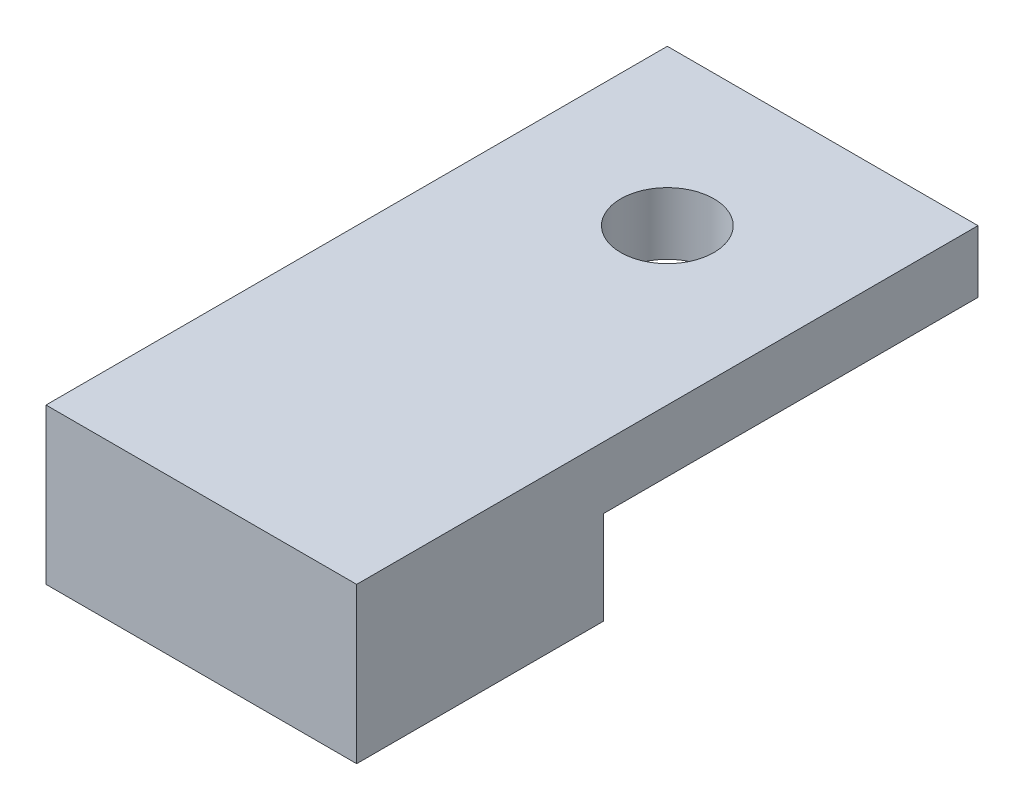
ISO-10303-21;
HEADER;
FILE_DESCRIPTION(('STEP AP214'),'2;1');
FILE_NAME('part.step','',(''),(''),'','','');
FILE_SCHEMA(('AUTOMOTIVE_DESIGN { 1 0 10303 214 1 1 1 1 }'));
ENDSEC;
DATA;
#1=APPLICATION_CONTEXT('core data for automotive mechanical design processes');
#2=APPLICATION_PROTOCOL_DEFINITION('international standard','automotive_design',2000,#1);
#3=PRODUCT_CONTEXT('',#1,'mechanical');
#4=PRODUCT('Part','Part','',(#3));
#5=PRODUCT_RELATED_PRODUCT_CATEGORY('part','',(#4));
#6=PRODUCT_DEFINITION_FORMATION('','',#4);
#7=PRODUCT_DEFINITION_CONTEXT('part definition',#1,'design');
#8=PRODUCT_DEFINITION('design','',#6,#7);
#9=PRODUCT_DEFINITION_SHAPE('','',#8);
#10=(LENGTH_UNIT() NAMED_UNIT(*) SI_UNIT(.MILLI.,.METRE.));
#11=(NAMED_UNIT(*) PLANE_ANGLE_UNIT() SI_UNIT($,.RADIAN.));
#12=(NAMED_UNIT(*) SI_UNIT($,.STERADIAN.) SOLID_ANGLE_UNIT());
#13=UNCERTAINTY_MEASURE_WITH_UNIT(LENGTH_MEASURE(1.E-05),#10,'distance_accuracy_value','');
#14=(GEOMETRIC_REPRESENTATION_CONTEXT(3) GLOBAL_UNCERTAINTY_ASSIGNED_CONTEXT((#13)) GLOBAL_UNIT_ASSIGNED_CONTEXT((#10,
#11,#12)) REPRESENTATION_CONTEXT('',''));
#15=CARTESIAN_POINT('',(0.,0.,0.));
#16=DIRECTION('',(0.,0.,1.));
#17=DIRECTION('',(1.,0.,0.));
#18=AXIS2_PLACEMENT_3D('',#15,#16,#17);
#19=CARTESIAN_POINT('',(10.,0.,-7.95));
#20=DIRECTION('',(0.,1.,0.));
#21=DIRECTION('',(0.,0.,1.));
#22=AXIS2_PLACEMENT_3D('',#19,#20,#21);
#23=PLANE('',#22);
#24=DIRECTION('',(0.,0.,-1.));
#25=VECTOR('',#24,1.);
#26=CARTESIAN_POINT('',(0.,0.,-7.95));
#27=LINE('',#26,#25);
#28=CARTESIAN_POINT('',(0.,0.,0.));
#29=VERTEX_POINT('',#28);
#30=CARTESIAN_POINT('',(0.,0.,-7.95));
#31=VERTEX_POINT('',#30);
#32=EDGE_CURVE('E117',#29,#31,#27,.T.);
#33=ORIENTED_EDGE('',*,*,#32,.T.);
#34=DIRECTION('',(-1.,0.,0.));
#35=VECTOR('',#34,1.);
#36=CARTESIAN_POINT('',(10.,0.,-7.95));
#37=LINE('',#36,#35);
#38=CARTESIAN_POINT('',(10.,0.,-7.95));
#39=VERTEX_POINT('',#38);
#40=EDGE_CURVE('E11',#39,#31,#37,.T.);
#41=ORIENTED_EDGE('',*,*,#40,.F.);
#42=DIRECTION('',(0.,0.,-1.));
#43=VECTOR('',#42,1.);
#44=CARTESIAN_POINT('',(10.,0.,-7.95));
#45=LINE('',#44,#43);
#46=CARTESIAN_POINT('',(10.,0.,0.));
#47=VERTEX_POINT('',#46);
#48=EDGE_CURVE('E128',#47,#39,#45,.T.);
#49=ORIENTED_EDGE('',*,*,#48,.F.);
#50=DIRECTION('',(-1.,0.,0.));
#51=VECTOR('',#50,1.);
#52=CARTESIAN_POINT('',(10.,0.,0.));
#53=LINE('',#52,#51);
#54=EDGE_CURVE('E113',#47,#29,#53,.T.);
#55=ORIENTED_EDGE('',*,*,#54,.T.);
#56=EDGE_LOOP('',(#33,#41,#49,#55));
#57=FACE_BOUND('',#56,.T.);
#58=ADVANCED_FACE('F33',(#57),#23,.F.);
#59=CARTESIAN_POINT('',(10.,3.,-7.95));
#60=DIRECTION('',(0.,0.,1.));
#61=DIRECTION('',(1.,0.,0.));
#62=AXIS2_PLACEMENT_3D('',#59,#60,#61);
#63=PLANE('',#62);
#64=DIRECTION('',(0.,1.,0.));
#65=VECTOR('',#64,1.);
#66=CARTESIAN_POINT('',(0.,3.,-7.95));
#67=LINE('',#66,#65);
#68=CARTESIAN_POINT('',(0.,3.,-7.95));
#69=VERTEX_POINT('',#68);
#70=EDGE_CURVE('E120',#31,#69,#67,.T.);
#71=ORIENTED_EDGE('',*,*,#70,.T.);
#72=DIRECTION('',(-1.,0.,0.));
#73=VECTOR('',#72,1.);
#74=CARTESIAN_POINT('',(10.,3.,-7.95));
#75=LINE('',#74,#73);
#76=CARTESIAN_POINT('',(10.,3.,-7.95));
#77=VERTEX_POINT('',#76);
#78=EDGE_CURVE('E41',#77,#69,#75,.T.);
#79=ORIENTED_EDGE('',*,*,#78,.F.);
#80=DIRECTION('',(0.,1.,0.));
#81=VECTOR('',#80,1.);
#82=CARTESIAN_POINT('',(10.,3.,-7.95));
#83=LINE('',#82,#81);
#84=EDGE_CURVE('E86',#39,#77,#83,.T.);
#85=ORIENTED_EDGE('',*,*,#84,.F.);
#86=ORIENTED_EDGE('',*,*,#40,.T.);
#87=EDGE_LOOP('',(#71,#79,#85,#86));
#88=FACE_BOUND('',#87,.T.);
#89=ADVANCED_FACE('F153',(#88),#63,.F.);
#90=CARTESIAN_POINT('',(10.,3.,-20.));
#91=DIRECTION('',(0.,1.,0.));
#92=DIRECTION('',(0.,0.,1.));
#93=AXIS2_PLACEMENT_3D('',#90,#91,#92);
#94=PLANE('',#93);
#95=CARTESIAN_POINT('',(5.,3.,-15.));
#96=DIRECTION('',(0.,1.,0.));
#97=DIRECTION('',(0.,0.,1.));
#98=AXIS2_PLACEMENT_3D('',#95,#96,#97);
#99=CIRCLE('',#98,1.5);
#100=CARTESIAN_POINT('',(5.,3.,-13.5));
#101=VERTEX_POINT('',#100);
#102=EDGE_CURVE('E121',#101,#101,#99,.T.);
#103=ORIENTED_EDGE('',*,*,#102,.T.);
#104=EDGE_LOOP('',(#103));
#105=FACE_BOUND('',#104,.T.);
#106=DIRECTION('',(0.,0.,-1.));
#107=VECTOR('',#106,1.);
#108=CARTESIAN_POINT('',(0.,3.,-20.));
#109=LINE('',#108,#107);
#110=CARTESIAN_POINT('',(0.,3.,-20.));
#111=VERTEX_POINT('',#110);
#112=EDGE_CURVE('E123',#69,#111,#109,.T.);
#113=ORIENTED_EDGE('',*,*,#112,.T.);
#114=DIRECTION('',(-1.,0.,0.));
#115=VECTOR('',#114,1.);
#116=CARTESIAN_POINT('',(10.,3.,-20.));
#117=LINE('',#116,#115);
#118=CARTESIAN_POINT('',(10.,3.,-20.));
#119=VERTEX_POINT('',#118);
#120=EDGE_CURVE('E108',#119,#111,#117,.T.);
#121=ORIENTED_EDGE('',*,*,#120,.F.);
#122=DIRECTION('',(0.,0.,-1.));
#123=VECTOR('',#122,1.);
#124=CARTESIAN_POINT('',(10.,3.,-20.));
#125=LINE('',#124,#123);
#126=EDGE_CURVE('E99',#77,#119,#125,.T.);
#127=ORIENTED_EDGE('',*,*,#126,.F.);
#128=ORIENTED_EDGE('',*,*,#78,.T.);
#129=EDGE_LOOP('',(#113,#121,#127,#128));
#130=FACE_BOUND('',#129,.T.);
#131=ADVANCED_FACE('F134',(#105,#130),#94,.F.);
#132=CARTESIAN_POINT('',(10.,5.,-20.));
#133=DIRECTION('',(0.,0.,1.));
#134=DIRECTION('',(1.,0.,0.));
#135=AXIS2_PLACEMENT_3D('',#132,#133,#134);
#136=PLANE('',#135);
#137=DIRECTION('',(0.,1.,0.));
#138=VECTOR('',#137,1.);
#139=CARTESIAN_POINT('',(0.,5.,-20.));
#140=LINE('',#139,#138);
#141=CARTESIAN_POINT('',(0.,5.,-20.));
#142=VERTEX_POINT('',#141);
#143=EDGE_CURVE('E107',#111,#142,#140,.T.);
#144=ORIENTED_EDGE('',*,*,#143,.T.);
#145=DIRECTION('',(-1.,0.,0.));
#146=VECTOR('',#145,1.);
#147=CARTESIAN_POINT('',(10.,5.,-20.));
#148=LINE('',#147,#146);
#149=CARTESIAN_POINT('',(10.,5.,-20.));
#150=VERTEX_POINT('',#149);
#151=EDGE_CURVE('E104',#150,#142,#148,.T.);
#152=ORIENTED_EDGE('',*,*,#151,.F.);
#153=DIRECTION('',(0.,1.,0.));
#154=VECTOR('',#153,1.);
#155=CARTESIAN_POINT('',(10.,5.,-20.));
#156=LINE('',#155,#154);
#157=EDGE_CURVE('E93',#119,#150,#156,.T.);
#158=ORIENTED_EDGE('',*,*,#157,.F.);
#159=ORIENTED_EDGE('',*,*,#120,.T.);
#160=EDGE_LOOP('',(#144,#152,#158,#159));
#161=FACE_BOUND('',#160,.T.);
#162=ADVANCED_FACE('F105',(#161),#136,.F.);
#163=CARTESIAN_POINT('',(10.,5.,0.));
#164=DIRECTION('',(0.,-1.,0.));
#165=DIRECTION('',(0.,0.,-1.));
#166=AXIS2_PLACEMENT_3D('',#163,#164,#165);
#167=PLANE('',#166);
#168=CARTESIAN_POINT('',(5.,5.,-15.));
#169=DIRECTION('',(0.,1.,0.));
#170=DIRECTION('',(0.,0.,1.));
#171=AXIS2_PLACEMENT_3D('',#168,#169,#170);
#172=CIRCLE('',#171,1.5);
#173=CARTESIAN_POINT('',(5.,5.,-13.5));
#174=VERTEX_POINT('',#173);
#175=EDGE_CURVE('E208',#174,#174,#172,.T.);
#176=ORIENTED_EDGE('',*,*,#175,.F.);
#177=EDGE_LOOP('',(#176));
#178=FACE_BOUND('',#177,.T.);
#179=DIRECTION('',(0.,0.,1.));
#180=VECTOR('',#179,1.);
#181=CARTESIAN_POINT('',(0.,5.,0.));
#182=LINE('',#181,#180);
#183=CARTESIAN_POINT('',(0.,5.,0.));
#184=VERTEX_POINT('',#183);
#185=EDGE_CURVE('E72',#142,#184,#182,.T.);
#186=ORIENTED_EDGE('',*,*,#185,.T.);
#187=DIRECTION('',(-1.,0.,0.));
#188=VECTOR('',#187,1.);
#189=CARTESIAN_POINT('',(10.,5.,0.));
#190=LINE('',#189,#188);
#191=CARTESIAN_POINT('',(10.,5.,0.));
#192=VERTEX_POINT('',#191);
#193=EDGE_CURVE('E109',#192,#184,#190,.T.);
#194=ORIENTED_EDGE('',*,*,#193,.F.);
#195=DIRECTION('',(0.,0.,1.));
#196=VECTOR('',#195,1.);
#197=CARTESIAN_POINT('',(10.,5.,0.));
#198=LINE('',#197,#196);
#199=EDGE_CURVE('E97',#150,#192,#198,.T.);
#200=ORIENTED_EDGE('',*,*,#199,.F.);
#201=ORIENTED_EDGE('',*,*,#151,.T.);
#202=EDGE_LOOP('',(#186,#194,#200,#201));
#203=FACE_BOUND('',#202,.T.);
#204=ADVANCED_FACE('F111',(#178,#203),#167,.F.);
#205=CARTESIAN_POINT('',(10.,0.,0.));
#206=DIRECTION('',(0.,0.,-1.));
#207=DIRECTION('',(-1.,0.,0.));
#208=AXIS2_PLACEMENT_3D('',#205,#206,#207);
#209=PLANE('',#208);
#210=DIRECTION('',(0.,-1.,0.));
#211=VECTOR('',#210,1.);
#212=CARTESIAN_POINT('',(0.,0.,0.));
#213=LINE('',#212,#211);
#214=EDGE_CURVE('E78',#184,#29,#213,.T.);
#215=ORIENTED_EDGE('',*,*,#214,.T.);
#216=ORIENTED_EDGE('',*,*,#54,.F.);
#217=DIRECTION('',(0.,-1.,0.));
#218=VECTOR('',#217,1.);
#219=CARTESIAN_POINT('',(10.,0.,0.));
#220=LINE('',#219,#218);
#221=EDGE_CURVE('E49',#192,#47,#220,.T.);
#222=ORIENTED_EDGE('',*,*,#221,.F.);
#223=ORIENTED_EDGE('',*,*,#193,.T.);
#224=EDGE_LOOP('',(#215,#216,#222,#223));
#225=FACE_BOUND('',#224,.T.);
#226=ADVANCED_FACE('F141',(#225),#209,.F.);
#227=CARTESIAN_POINT('',(10.,0.,0.));
#228=DIRECTION('',(-1.,0.,0.));
#229=DIRECTION('',(0.,0.,1.));
#230=AXIS2_PLACEMENT_3D('',#227,#228,#229);
#231=PLANE('',#230);
#232=ORIENTED_EDGE('',*,*,#48,.T.);
#233=ORIENTED_EDGE('',*,*,#84,.T.);
#234=ORIENTED_EDGE('',*,*,#126,.T.);
#235=ORIENTED_EDGE('',*,*,#157,.T.);
#236=ORIENTED_EDGE('',*,*,#199,.T.);
#237=ORIENTED_EDGE('',*,*,#221,.T.);
#238=EDGE_LOOP('',(#232,#233,#234,#235,#236,#237));
#239=FACE_BOUND('',#238,.T.);
#240=ADVANCED_FACE('F95',(#239),#231,.F.);
#241=CARTESIAN_POINT('',(0.,0.,0.));
#242=DIRECTION('',(-1.,0.,0.));
#243=DIRECTION('',(0.,0.,1.));
#244=AXIS2_PLACEMENT_3D('',#241,#242,#243);
#245=PLANE('',#244);
#246=ORIENTED_EDGE('',*,*,#32,.F.);
#247=ORIENTED_EDGE('',*,*,#214,.F.);
#248=ORIENTED_EDGE('',*,*,#185,.F.);
#249=ORIENTED_EDGE('',*,*,#143,.F.);
#250=ORIENTED_EDGE('',*,*,#112,.F.);
#251=ORIENTED_EDGE('',*,*,#70,.F.);
#252=EDGE_LOOP('',(#246,#247,#248,#249,#250,#251));
#253=FACE_BOUND('',#252,.T.);
#254=ADVANCED_FACE('F137',(#253),#245,.T.);
#255=CARTESIAN_POINT('',(5.,-5.,-15.));
#256=DIRECTION('',(0.,1.,0.));
#257=DIRECTION('',(0.,0.,1.));
#258=AXIS2_PLACEMENT_3D('',#255,#256,#257);
#259=CYLINDRICAL_SURFACE('',#258,1.5);
#260=ORIENTED_EDGE('',*,*,#175,.T.);
#261=EDGE_LOOP('',(#260));
#262=FACE_BOUND('',#261,.T.);
#263=ORIENTED_EDGE('',*,*,#102,.F.);
#264=EDGE_LOOP('',(#263));
#265=FACE_BOUND('',#264,.T.);
#266=ADVANCED_FACE('F181',(#262,#265),#259,.F.);
#267=CLOSED_SHELL('',(#58,#89,#131,#162,#204,#226,#240,#254,#266));
#268=MANIFOLD_SOLID_BREP('B2',#267);
#269=ADVANCED_BREP_SHAPE_REPRESENTATION('',(#18,#268),#14);
#270=SHAPE_DEFINITION_REPRESENTATION(#9,#269);
ENDSEC;
END-ISO-10303-21;
